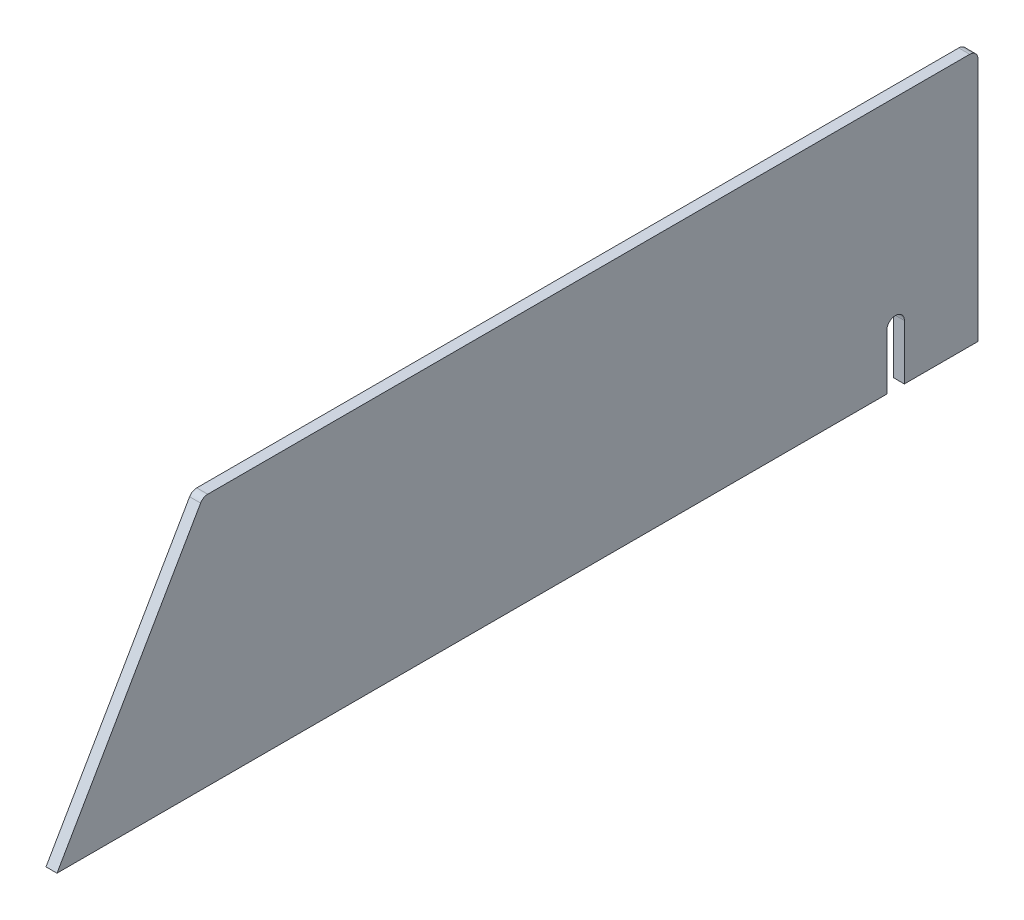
from build123d import *

# Parameters (mm, degrees)
BOSS_EXTRUDE1_DEPTH = 2
FILLET1_R           = 1.5
CUT_EXTRUDE3_DEPTH  = 122.611383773


with BuildPart() as part:
    # Sketch1 → Boss-Extrude1 (new body)
    with BuildSketch(Plane(origin=(0, 0, 0), x_dir=(0, 0, -1), z_dir=(1, 0, 0))):
        Polygon((0, 0), (55, 0), (55, -46), (-112.558112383, -46), (-86, 0), align=None)
    extrude(amount=BOSS_EXTRUDE1_DEPTH)

    # Fillet1
    fillet1_edges = [part.edges().sort_by_distance(p)[0] for p in [
        (1, 0, -55),
        (1, 0, 86),
    ]]
    fillet(fillet1_edges, radius=FILLET1_R)

    # Sketch7 → Cut-Extrude3 (cut, through all)
    with BuildSketch(Plane(origin=(2, 0, 0), x_dir=(0, 0, -1), z_dir=(1, 0, 0))):
        with BuildLine():
            Line((41.6, -36), (41.6, -48.860557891))
            ThreePointArc((41.6, -48.860557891), (40, -50.460557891), (38.4, -48.860557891))
            Line((38.4, -48.860557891), (38.4, -36))
            ThreePointArc((38.4, -36), (40, -34.4), (41.6, -36))
        make_face()
    extrude(amount=-CUT_EXTRUDE3_DEPTH, mode=Mode.SUBTRACT)


solid = part.part
